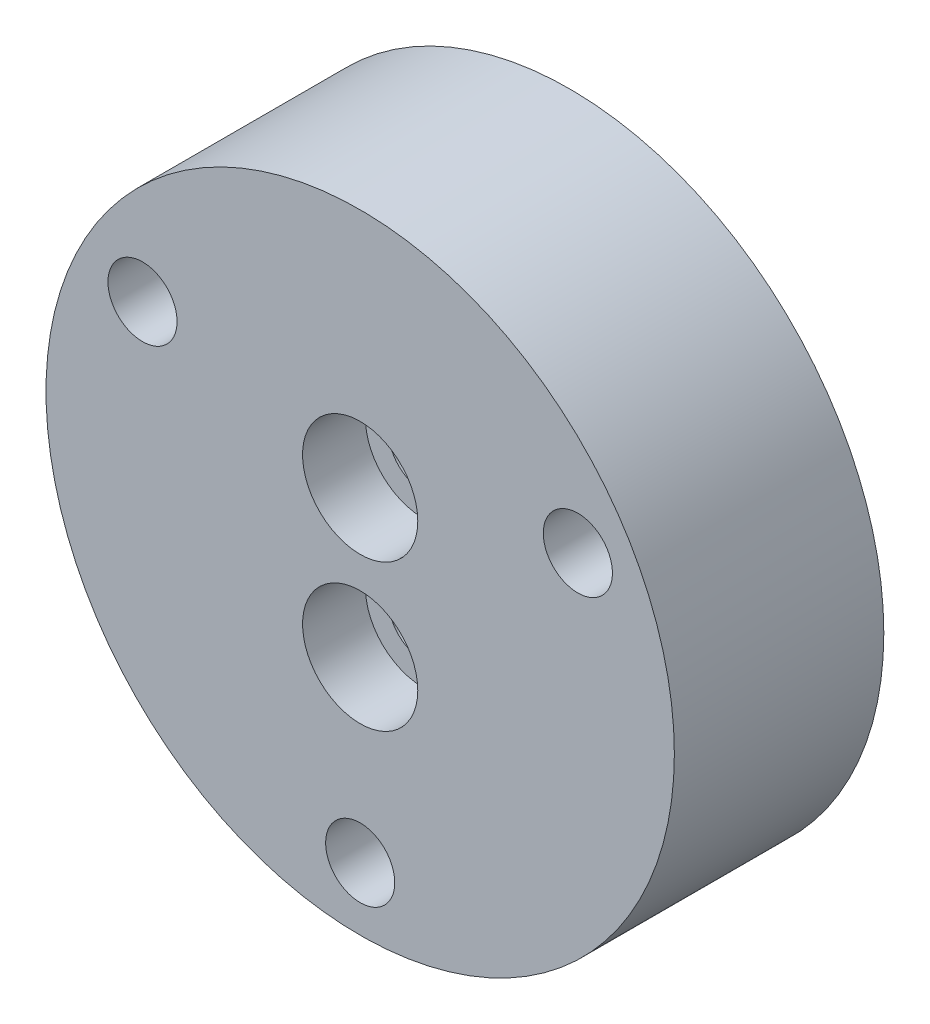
ISO-10303-21;
HEADER;
FILE_DESCRIPTION(('STEP AP214'),'2;1');
FILE_NAME('part.step','',(''),(''),'','','');
FILE_SCHEMA(('AUTOMOTIVE_DESIGN { 1 0 10303 214 1 1 1 1 }'));
ENDSEC;
DATA;
#1=APPLICATION_CONTEXT('core data for automotive mechanical design processes');
#2=APPLICATION_PROTOCOL_DEFINITION('international standard','automotive_design',2000,#1);
#3=PRODUCT_CONTEXT('',#1,'mechanical');
#4=PRODUCT('Part','Part','',(#3));
#5=PRODUCT_RELATED_PRODUCT_CATEGORY('part','',(#4));
#6=PRODUCT_DEFINITION_FORMATION('','',#4);
#7=PRODUCT_DEFINITION_CONTEXT('part definition',#1,'design');
#8=PRODUCT_DEFINITION('design','',#6,#7);
#9=PRODUCT_DEFINITION_SHAPE('','',#8);
#10=(LENGTH_UNIT() NAMED_UNIT(*) SI_UNIT(.MILLI.,.METRE.));
#11=(NAMED_UNIT(*) PLANE_ANGLE_UNIT() SI_UNIT($,.RADIAN.));
#12=(NAMED_UNIT(*) SI_UNIT($,.STERADIAN.) SOLID_ANGLE_UNIT());
#13=UNCERTAINTY_MEASURE_WITH_UNIT(LENGTH_MEASURE(1.E-05),#10,'distance_accuracy_value','');
#14=(GEOMETRIC_REPRESENTATION_CONTEXT(3) GLOBAL_UNCERTAINTY_ASSIGNED_CONTEXT((#13)) GLOBAL_UNIT_ASSIGNED_CONTEXT((#10,
#11,#12)) REPRESENTATION_CONTEXT('',''));
#15=CARTESIAN_POINT('',(0.,0.,0.));
#16=DIRECTION('',(0.,0.,1.));
#17=DIRECTION('',(1.,0.,0.));
#18=AXIS2_PLACEMENT_3D('',#15,#16,#17);
#19=CARTESIAN_POINT('',(0.,0.,20.));
#20=DIRECTION('',(0.,0.,1.));
#21=DIRECTION('',(1.,0.,0.));
#22=AXIS2_PLACEMENT_3D('',#19,#20,#21);
#23=PLANE('',#22);
#24=CARTESIAN_POINT('',(20.7846096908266,11.9999999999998,20.));
#25=DIRECTION('',(0.,0.,-1.));
#26=DIRECTION('',(-1.,0.,0.));
#27=AXIS2_PLACEMENT_3D('',#24,#25,#26);
#28=CIRCLE('',#27,3.29999999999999);
#29=CARTESIAN_POINT('',(17.4846096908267,11.9999999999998,20.));
#30=VERTEX_POINT('',#29);
#31=EDGE_CURVE('E97',#30,#30,#28,.T.);
#32=ORIENTED_EDGE('',*,*,#31,.T.);
#33=EDGE_LOOP('',(#32));
#34=FACE_BOUND('',#33,.T.);
#35=CARTESIAN_POINT('',(-20.7846096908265,12.0000000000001,20.));
#36=DIRECTION('',(0.,0.,-1.));
#37=DIRECTION('',(-1.,0.,0.));
#38=AXIS2_PLACEMENT_3D('',#35,#36,#37);
#39=CIRCLE('',#38,3.29999999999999);
#40=CARTESIAN_POINT('',(-24.0846096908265,12.0000000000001,20.));
#41=VERTEX_POINT('',#40);
#42=EDGE_CURVE('E85',#41,#41,#39,.T.);
#43=ORIENTED_EDGE('',*,*,#42,.T.);
#44=EDGE_LOOP('',(#43));
#45=FACE_BOUND('',#44,.T.);
#46=CARTESIAN_POINT('',(0.,0.,20.));
#47=DIRECTION('',(0.,0.,1.));
#48=DIRECTION('',(1.,0.,0.));
#49=AXIS2_PLACEMENT_3D('',#46,#47,#48);
#50=CIRCLE('',#49,30.);
#51=CARTESIAN_POINT('',(30.,0.,20.));
#52=VERTEX_POINT('',#51);
#53=EDGE_CURVE('E10',#52,#52,#50,.T.);
#54=ORIENTED_EDGE('',*,*,#53,.T.);
#55=EDGE_LOOP('',(#54));
#56=FACE_BOUND('',#55,.T.);
#57=CARTESIAN_POINT('',(0.,-7.00000000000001,20.));
#58=DIRECTION('',(0.,0.,1.));
#59=DIRECTION('',(1.,0.,0.));
#60=AXIS2_PLACEMENT_3D('',#57,#58,#59);
#61=CIRCLE('',#60,5.5);
#62=CARTESIAN_POINT('',(5.50000000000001,-7.00000000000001,20.));
#63=VERTEX_POINT('',#62);
#64=EDGE_CURVE('E39',#63,#63,#61,.T.);
#65=ORIENTED_EDGE('',*,*,#64,.F.);
#66=EDGE_LOOP('',(#65));
#67=FACE_BOUND('',#66,.T.);
#68=CARTESIAN_POINT('',(0.,6.99999999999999,20.));
#69=DIRECTION('',(0.,0.,1.));
#70=DIRECTION('',(1.,0.,0.));
#71=AXIS2_PLACEMENT_3D('',#68,#69,#70);
#72=CIRCLE('',#71,5.5);
#73=CARTESIAN_POINT('',(5.50000000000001,6.99999999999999,20.));
#74=VERTEX_POINT('',#73);
#75=EDGE_CURVE('E52',#74,#74,#72,.T.);
#76=ORIENTED_EDGE('',*,*,#75,.F.);
#77=EDGE_LOOP('',(#76));
#78=FACE_BOUND('',#77,.T.);
#79=CARTESIAN_POINT('',(0.,-24.,20.));
#80=DIRECTION('',(0.,0.,-1.));
#81=DIRECTION('',(-1.,0.,0.));
#82=AXIS2_PLACEMENT_3D('',#79,#80,#81);
#83=CIRCLE('',#82,3.29999999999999);
#84=CARTESIAN_POINT('',(-3.29999999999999,-24.,20.));
#85=VERTEX_POINT('',#84);
#86=EDGE_CURVE('E73',#85,#85,#83,.T.);
#87=ORIENTED_EDGE('',*,*,#86,.T.);
#88=EDGE_LOOP('',(#87));
#89=FACE_BOUND('',#88,.T.);
#90=ADVANCED_FACE('F28',(#34,#45,#56,#67,#78,#89),#23,.T.);
#91=CARTESIAN_POINT('',(0.,0.,20.));
#92=DIRECTION('',(0.,0.,-1.));
#93=DIRECTION('',(-1.,0.,0.));
#94=AXIS2_PLACEMENT_3D('',#91,#92,#93);
#95=CYLINDRICAL_SURFACE('',#94,30.);
#96=ORIENTED_EDGE('',*,*,#53,.F.);
#97=EDGE_LOOP('',(#96));
#98=FACE_BOUND('',#97,.T.);
#99=CARTESIAN_POINT('',(0.,0.,0.));
#100=DIRECTION('',(0.,0.,1.));
#101=DIRECTION('',(1.,0.,0.));
#102=AXIS2_PLACEMENT_3D('',#99,#100,#101);
#103=CIRCLE('',#102,30.);
#104=CARTESIAN_POINT('',(30.,0.,0.));
#105=VERTEX_POINT('',#104);
#106=EDGE_CURVE('E32',#105,#105,#103,.T.);
#107=ORIENTED_EDGE('',*,*,#106,.T.);
#108=EDGE_LOOP('',(#107));
#109=FACE_BOUND('',#108,.T.);
#110=ADVANCED_FACE('F30',(#98,#109),#95,.T.);
#111=CARTESIAN_POINT('',(0.,0.,0.));
#112=DIRECTION('',(0.,0.,1.));
#113=DIRECTION('',(1.,0.,0.));
#114=AXIS2_PLACEMENT_3D('',#111,#112,#113);
#115=PLANE('',#114);
#116=CARTESIAN_POINT('',(20.7846096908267,11.9999999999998,0.));
#117=DIRECTION('',(0.,0.,-1.));
#118=DIRECTION('',(-1.,0.,0.));
#119=AXIS2_PLACEMENT_3D('',#116,#117,#118);
#120=CIRCLE('',#119,5.49999999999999);
#121=CARTESIAN_POINT('',(15.2846096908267,11.9999999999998,0.));
#122=VERTEX_POINT('',#121);
#123=EDGE_CURVE('E88',#122,#122,#120,.T.);
#124=ORIENTED_EDGE('',*,*,#123,.F.);
#125=EDGE_LOOP('',(#124));
#126=FACE_BOUND('',#125,.T.);
#127=CARTESIAN_POINT('',(-20.7846096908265,12.0000000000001,0.));
#128=DIRECTION('',(0.,0.,-1.));
#129=DIRECTION('',(-1.,0.,0.));
#130=AXIS2_PLACEMENT_3D('',#127,#128,#129);
#131=CIRCLE('',#130,5.49999999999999);
#132=CARTESIAN_POINT('',(-26.2846096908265,12.0000000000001,0.));
#133=VERTEX_POINT('',#132);
#134=EDGE_CURVE('E76',#133,#133,#131,.T.);
#135=ORIENTED_EDGE('',*,*,#134,.F.);
#136=EDGE_LOOP('',(#135));
#137=FACE_BOUND('',#136,.T.);
#138=CARTESIAN_POINT('',(0.,-24.,0.));
#139=DIRECTION('',(0.,0.,-1.));
#140=DIRECTION('',(-1.,0.,0.));
#141=AXIS2_PLACEMENT_3D('',#138,#139,#140);
#142=CIRCLE('',#141,5.49999999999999);
#143=CARTESIAN_POINT('',(-5.49999999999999,-24.,0.));
#144=VERTEX_POINT('',#143);
#145=EDGE_CURVE('E64',#144,#144,#142,.T.);
#146=ORIENTED_EDGE('',*,*,#145,.F.);
#147=EDGE_LOOP('',(#146));
#148=FACE_BOUND('',#147,.T.);
#149=CARTESIAN_POINT('',(0.,6.99999999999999,0.));
#150=DIRECTION('',(0.,0.,1.));
#151=DIRECTION('',(1.,0.,0.));
#152=AXIS2_PLACEMENT_3D('',#149,#150,#151);
#153=CIRCLE('',#152,3.3);
#154=CARTESIAN_POINT('',(3.3,6.99999999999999,0.));
#155=VERTEX_POINT('',#154);
#156=EDGE_CURVE('E61',#155,#155,#153,.T.);
#157=ORIENTED_EDGE('',*,*,#156,.T.);
#158=EDGE_LOOP('',(#157));
#159=FACE_BOUND('',#158,.T.);
#160=CARTESIAN_POINT('',(0.,-7.00000000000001,0.));
#161=DIRECTION('',(0.,0.,1.));
#162=DIRECTION('',(1.,0.,0.));
#163=AXIS2_PLACEMENT_3D('',#160,#161,#162);
#164=CIRCLE('',#163,3.3);
#165=CARTESIAN_POINT('',(3.3,-7.00000000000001,0.));
#166=VERTEX_POINT('',#165);
#167=EDGE_CURVE('E49',#166,#166,#164,.T.);
#168=ORIENTED_EDGE('',*,*,#167,.T.);
#169=EDGE_LOOP('',(#168));
#170=FACE_BOUND('',#169,.T.);
#171=ORIENTED_EDGE('',*,*,#106,.F.);
#172=EDGE_LOOP('',(#171));
#173=FACE_BOUND('',#172,.T.);
#174=ADVANCED_FACE('F122',(#126,#137,#148,#159,#170,#173),#115,.F.);
#175=CARTESIAN_POINT('',(0.,-7.00000000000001,20.));
#176=DIRECTION('',(0.,0.,1.));
#177=DIRECTION('',(1.,0.,0.));
#178=AXIS2_PLACEMENT_3D('',#175,#176,#177);
#179=CYLINDRICAL_SURFACE('',#178,5.5);
#180=CARTESIAN_POINT('',(0.,-7.00000000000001,14.));
#181=DIRECTION('',(0.,0.,1.));
#182=DIRECTION('',(1.,0.,0.));
#183=AXIS2_PLACEMENT_3D('',#180,#181,#182);
#184=CIRCLE('',#183,5.5);
#185=CARTESIAN_POINT('',(5.5,-7.00000000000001,14.));
#186=VERTEX_POINT('',#185);
#187=EDGE_CURVE('E43',#186,#186,#184,.T.);
#188=ORIENTED_EDGE('',*,*,#187,.F.);
#189=EDGE_LOOP('',(#188));
#190=FACE_BOUND('',#189,.T.);
#191=ORIENTED_EDGE('',*,*,#64,.T.);
#192=EDGE_LOOP('',(#191));
#193=FACE_BOUND('',#192,.T.);
#194=ADVANCED_FACE('F125',(#190,#193),#179,.F.);
#195=CARTESIAN_POINT('',(3.3,-6.99999999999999,14.));
#196=DIRECTION('',(0.,0.,-1.));
#197=DIRECTION('',(-1.,0.,0.));
#198=AXIS2_PLACEMENT_3D('',#195,#196,#197);
#199=PLANE('',#198);
#200=CARTESIAN_POINT('',(0.,-7.00000000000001,14.));
#201=DIRECTION('',(0.,0.,1.));
#202=DIRECTION('',(1.,0.,0.));
#203=AXIS2_PLACEMENT_3D('',#200,#201,#202);
#204=CIRCLE('',#203,3.3);
#205=CARTESIAN_POINT('',(3.3,-7.00000000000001,14.));
#206=VERTEX_POINT('',#205);
#207=EDGE_CURVE('E46',#206,#206,#204,.T.);
#208=ORIENTED_EDGE('',*,*,#207,.F.);
#209=EDGE_LOOP('',(#208));
#210=FACE_BOUND('',#209,.T.);
#211=ORIENTED_EDGE('',*,*,#187,.T.);
#212=EDGE_LOOP('',(#211));
#213=FACE_BOUND('',#212,.T.);
#214=ADVANCED_FACE('F147',(#210,#213),#199,.F.);
#215=CARTESIAN_POINT('',(0.,-7.00000000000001,20.));
#216=DIRECTION('',(0.,0.,1.));
#217=DIRECTION('',(1.,0.,0.));
#218=AXIS2_PLACEMENT_3D('',#215,#216,#217);
#219=CYLINDRICAL_SURFACE('',#218,3.3);
#220=ORIENTED_EDGE('',*,*,#167,.F.);
#221=EDGE_LOOP('',(#220));
#222=FACE_BOUND('',#221,.T.);
#223=ORIENTED_EDGE('',*,*,#207,.T.);
#224=EDGE_LOOP('',(#223));
#225=FACE_BOUND('',#224,.T.);
#226=ADVANCED_FACE('F151',(#222,#225),#219,.F.);
#227=CARTESIAN_POINT('',(0.,6.99999999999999,20.));
#228=DIRECTION('',(0.,0.,1.));
#229=DIRECTION('',(1.,0.,0.));
#230=AXIS2_PLACEMENT_3D('',#227,#228,#229);
#231=CYLINDRICAL_SURFACE('',#230,5.5);
#232=CARTESIAN_POINT('',(0.,7.00000000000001,14.));
#233=DIRECTION('',(0.,0.,1.));
#234=DIRECTION('',(1.,0.,0.));
#235=AXIS2_PLACEMENT_3D('',#232,#233,#234);
#236=CIRCLE('',#235,5.5);
#237=CARTESIAN_POINT('',(5.50000000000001,7.00000000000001,14.));
#238=VERTEX_POINT('',#237);
#239=EDGE_CURVE('E55',#238,#238,#236,.T.);
#240=ORIENTED_EDGE('',*,*,#239,.F.);
#241=EDGE_LOOP('',(#240));
#242=FACE_BOUND('',#241,.T.);
#243=ORIENTED_EDGE('',*,*,#75,.T.);
#244=EDGE_LOOP('',(#243));
#245=FACE_BOUND('',#244,.T.);
#246=ADVANCED_FACE('F155',(#242,#245),#231,.F.);
#247=CARTESIAN_POINT('',(3.3,7.00000000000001,14.));
#248=DIRECTION('',(0.,0.,-1.));
#249=DIRECTION('',(-1.,0.,0.));
#250=AXIS2_PLACEMENT_3D('',#247,#248,#249);
#251=PLANE('',#250);
#252=CARTESIAN_POINT('',(0.,7.00000000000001,14.));
#253=DIRECTION('',(0.,0.,1.));
#254=DIRECTION('',(1.,0.,0.));
#255=AXIS2_PLACEMENT_3D('',#252,#253,#254);
#256=CIRCLE('',#255,3.3);
#257=CARTESIAN_POINT('',(3.30000000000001,7.00000000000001,14.));
#258=VERTEX_POINT('',#257);
#259=EDGE_CURVE('E58',#258,#258,#256,.T.);
#260=ORIENTED_EDGE('',*,*,#259,.F.);
#261=EDGE_LOOP('',(#260));
#262=FACE_BOUND('',#261,.T.);
#263=ORIENTED_EDGE('',*,*,#239,.T.);
#264=EDGE_LOOP('',(#263));
#265=FACE_BOUND('',#264,.T.);
#266=ADVANCED_FACE('F159',(#262,#265),#251,.F.);
#267=CARTESIAN_POINT('',(0.,6.99999999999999,20.));
#268=DIRECTION('',(0.,0.,1.));
#269=DIRECTION('',(1.,0.,0.));
#270=AXIS2_PLACEMENT_3D('',#267,#268,#269);
#271=CYLINDRICAL_SURFACE('',#270,3.3);
#272=ORIENTED_EDGE('',*,*,#156,.F.);
#273=EDGE_LOOP('',(#272));
#274=FACE_BOUND('',#273,.T.);
#275=ORIENTED_EDGE('',*,*,#259,.T.);
#276=EDGE_LOOP('',(#275));
#277=FACE_BOUND('',#276,.T.);
#278=ADVANCED_FACE('F163',(#274,#277),#271,.F.);
#279=CARTESIAN_POINT('',(0.,-24.,0.));
#280=DIRECTION('',(0.,0.,-1.));
#281=DIRECTION('',(-1.,0.,0.));
#282=AXIS2_PLACEMENT_3D('',#279,#280,#281);
#283=CYLINDRICAL_SURFACE('',#282,5.49999999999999);
#284=CARTESIAN_POINT('',(0.,-24.,6.00000000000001));
#285=DIRECTION('',(0.,0.,-1.));
#286=DIRECTION('',(-1.,0.,0.));
#287=AXIS2_PLACEMENT_3D('',#284,#285,#286);
#288=CIRCLE('',#287,5.49999999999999);
#289=CARTESIAN_POINT('',(-5.49999999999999,-24.,6.00000000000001));
#290=VERTEX_POINT('',#289);
#291=EDGE_CURVE('E67',#290,#290,#288,.T.);
#292=ORIENTED_EDGE('',*,*,#291,.F.);
#293=EDGE_LOOP('',(#292));
#294=FACE_BOUND('',#293,.T.);
#295=ORIENTED_EDGE('',*,*,#145,.T.);
#296=EDGE_LOOP('',(#295));
#297=FACE_BOUND('',#296,.T.);
#298=ADVANCED_FACE('F167',(#294,#297),#283,.F.);
#299=CARTESIAN_POINT('',(3.3,-24.,6.00000000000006));
#300=DIRECTION('',(0.,0.,1.));
#301=DIRECTION('',(1.,0.,0.));
#302=AXIS2_PLACEMENT_3D('',#299,#300,#301);
#303=PLANE('',#302);
#304=CARTESIAN_POINT('',(0.,-24.,6.00000000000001));
#305=DIRECTION('',(0.,0.,-1.));
#306=DIRECTION('',(-1.,0.,0.));
#307=AXIS2_PLACEMENT_3D('',#304,#305,#306);
#308=CIRCLE('',#307,3.30000000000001);
#309=CARTESIAN_POINT('',(-3.30000000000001,-24.,6.00000000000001));
#310=VERTEX_POINT('',#309);
#311=EDGE_CURVE('E70',#310,#310,#308,.T.);
#312=ORIENTED_EDGE('',*,*,#311,.F.);
#313=EDGE_LOOP('',(#312));
#314=FACE_BOUND('',#313,.T.);
#315=ORIENTED_EDGE('',*,*,#291,.T.);
#316=EDGE_LOOP('',(#315));
#317=FACE_BOUND('',#316,.T.);
#318=ADVANCED_FACE('F171',(#314,#317),#303,.F.);
#319=CARTESIAN_POINT('',(0.,-24.,0.));
#320=DIRECTION('',(0.,0.,-1.));
#321=DIRECTION('',(-1.,0.,0.));
#322=AXIS2_PLACEMENT_3D('',#319,#320,#321);
#323=CYLINDRICAL_SURFACE('',#322,3.3);
#324=ORIENTED_EDGE('',*,*,#86,.F.);
#325=EDGE_LOOP('',(#324));
#326=FACE_BOUND('',#325,.T.);
#327=ORIENTED_EDGE('',*,*,#311,.T.);
#328=EDGE_LOOP('',(#327));
#329=FACE_BOUND('',#328,.T.);
#330=ADVANCED_FACE('F175',(#326,#329),#323,.F.);
#331=CARTESIAN_POINT('',(-20.7846096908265,12.0000000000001,0.));
#332=DIRECTION('',(0.,0.,-1.));
#333=DIRECTION('',(-1.,0.,0.));
#334=AXIS2_PLACEMENT_3D('',#331,#332,#333);
#335=CYLINDRICAL_SURFACE('',#334,5.49999999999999);
#336=CARTESIAN_POINT('',(-20.7846096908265,12.0000000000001,6.00000000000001));
#337=DIRECTION('',(0.,0.,-1.));
#338=DIRECTION('',(-1.,0.,0.));
#339=AXIS2_PLACEMENT_3D('',#336,#337,#338);
#340=CIRCLE('',#339,5.49999999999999);
#341=CARTESIAN_POINT('',(-26.2846096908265,12.0000000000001,6.00000000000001));
#342=VERTEX_POINT('',#341);
#343=EDGE_CURVE('E79',#342,#342,#340,.T.);
#344=ORIENTED_EDGE('',*,*,#343,.F.);
#345=EDGE_LOOP('',(#344));
#346=FACE_BOUND('',#345,.T.);
#347=ORIENTED_EDGE('',*,*,#134,.T.);
#348=EDGE_LOOP('',(#347));
#349=FACE_BOUND('',#348,.T.);
#350=ADVANCED_FACE('F179',(#346,#349),#335,.F.);
#351=CARTESIAN_POINT('',(-17.4846096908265,12.0000000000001,6.00000000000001));
#352=DIRECTION('',(0.,0.,1.));
#353=DIRECTION('',(1.,0.,0.));
#354=AXIS2_PLACEMENT_3D('',#351,#352,#353);
#355=PLANE('',#354);
#356=CARTESIAN_POINT('',(-20.7846096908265,12.0000000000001,6.00000000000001));
#357=DIRECTION('',(0.,0.,-1.));
#358=DIRECTION('',(-1.,0.,0.));
#359=AXIS2_PLACEMENT_3D('',#356,#357,#358);
#360=CIRCLE('',#359,3.30000000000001);
#361=CARTESIAN_POINT('',(-24.0846096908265,12.0000000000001,6.00000000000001));
#362=VERTEX_POINT('',#361);
#363=EDGE_CURVE('E82',#362,#362,#360,.T.);
#364=ORIENTED_EDGE('',*,*,#363,.F.);
#365=EDGE_LOOP('',(#364));
#366=FACE_BOUND('',#365,.T.);
#367=ORIENTED_EDGE('',*,*,#343,.T.);
#368=EDGE_LOOP('',(#367));
#369=FACE_BOUND('',#368,.T.);
#370=ADVANCED_FACE('F183',(#366,#369),#355,.F.);
#371=CARTESIAN_POINT('',(-20.7846096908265,12.0000000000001,0.));
#372=DIRECTION('',(0.,0.,-1.));
#373=DIRECTION('',(-1.,0.,0.));
#374=AXIS2_PLACEMENT_3D('',#371,#372,#373);
#375=CYLINDRICAL_SURFACE('',#374,3.3);
#376=ORIENTED_EDGE('',*,*,#42,.F.);
#377=EDGE_LOOP('',(#376));
#378=FACE_BOUND('',#377,.T.);
#379=ORIENTED_EDGE('',*,*,#363,.T.);
#380=EDGE_LOOP('',(#379));
#381=FACE_BOUND('',#380,.T.);
#382=ADVANCED_FACE('F118',(#378,#381),#375,.F.);
#383=CARTESIAN_POINT('',(20.7846096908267,11.9999999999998,0.));
#384=DIRECTION('',(0.,0.,-1.));
#385=DIRECTION('',(-1.,0.,0.));
#386=AXIS2_PLACEMENT_3D('',#383,#384,#385);
#387=CYLINDRICAL_SURFACE('',#386,5.49999999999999);
#388=CARTESIAN_POINT('',(20.7846096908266,11.9999999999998,6.00000000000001));
#389=DIRECTION('',(0.,0.,-1.));
#390=DIRECTION('',(-1.,0.,0.));
#391=AXIS2_PLACEMENT_3D('',#388,#389,#390);
#392=CIRCLE('',#391,5.49999999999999);
#393=CARTESIAN_POINT('',(15.2846096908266,11.9999999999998,6.00000000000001));
#394=VERTEX_POINT('',#393);
#395=EDGE_CURVE('E91',#394,#394,#392,.T.);
#396=ORIENTED_EDGE('',*,*,#395,.F.);
#397=EDGE_LOOP('',(#396));
#398=FACE_BOUND('',#397,.T.);
#399=ORIENTED_EDGE('',*,*,#123,.T.);
#400=EDGE_LOOP('',(#399));
#401=FACE_BOUND('',#400,.T.);
#402=ADVANCED_FACE('F112',(#398,#401),#387,.F.);
#403=CARTESIAN_POINT('',(24.0846096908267,11.9999999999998,6.00000000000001));
#404=DIRECTION('',(0.,0.,1.));
#405=DIRECTION('',(1.,0.,0.));
#406=AXIS2_PLACEMENT_3D('',#403,#404,#405);
#407=PLANE('',#406);
#408=CARTESIAN_POINT('',(20.7846096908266,11.9999999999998,6.00000000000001));
#409=DIRECTION('',(0.,0.,-1.));
#410=DIRECTION('',(-1.,0.,0.));
#411=AXIS2_PLACEMENT_3D('',#408,#409,#410);
#412=CIRCLE('',#411,3.30000000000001);
#413=CARTESIAN_POINT('',(17.4846096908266,11.9999999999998,6.00000000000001));
#414=VERTEX_POINT('',#413);
#415=EDGE_CURVE('E94',#414,#414,#412,.T.);
#416=ORIENTED_EDGE('',*,*,#415,.F.);
#417=EDGE_LOOP('',(#416));
#418=FACE_BOUND('',#417,.T.);
#419=ORIENTED_EDGE('',*,*,#395,.T.);
#420=EDGE_LOOP('',(#419));
#421=FACE_BOUND('',#420,.T.);
#422=ADVANCED_FACE('F106',(#418,#421),#407,.F.);
#423=CARTESIAN_POINT('',(20.7846096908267,11.9999999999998,0.));
#424=DIRECTION('',(0.,0.,-1.));
#425=DIRECTION('',(-1.,0.,0.));
#426=AXIS2_PLACEMENT_3D('',#423,#424,#425);
#427=CYLINDRICAL_SURFACE('',#426,3.3);
#428=ORIENTED_EDGE('',*,*,#31,.F.);
#429=EDGE_LOOP('',(#428));
#430=FACE_BOUND('',#429,.T.);
#431=ORIENTED_EDGE('',*,*,#415,.T.);
#432=EDGE_LOOP('',(#431));
#433=FACE_BOUND('',#432,.T.);
#434=ADVANCED_FACE('F103',(#430,#433),#427,.F.);
#435=CLOSED_SHELL('',(#90,#110,#174,#194,#214,#226,#246,#266,#278,#298,#318,#330,#350,#370,#382,
#402,#422,#434));
#436=MANIFOLD_SOLID_BREP('B2',#435);
#437=ADVANCED_BREP_SHAPE_REPRESENTATION('',(#18,#436),#14);
#438=SHAPE_DEFINITION_REPRESENTATION(#9,#437);
ENDSEC;
END-ISO-10303-21;
